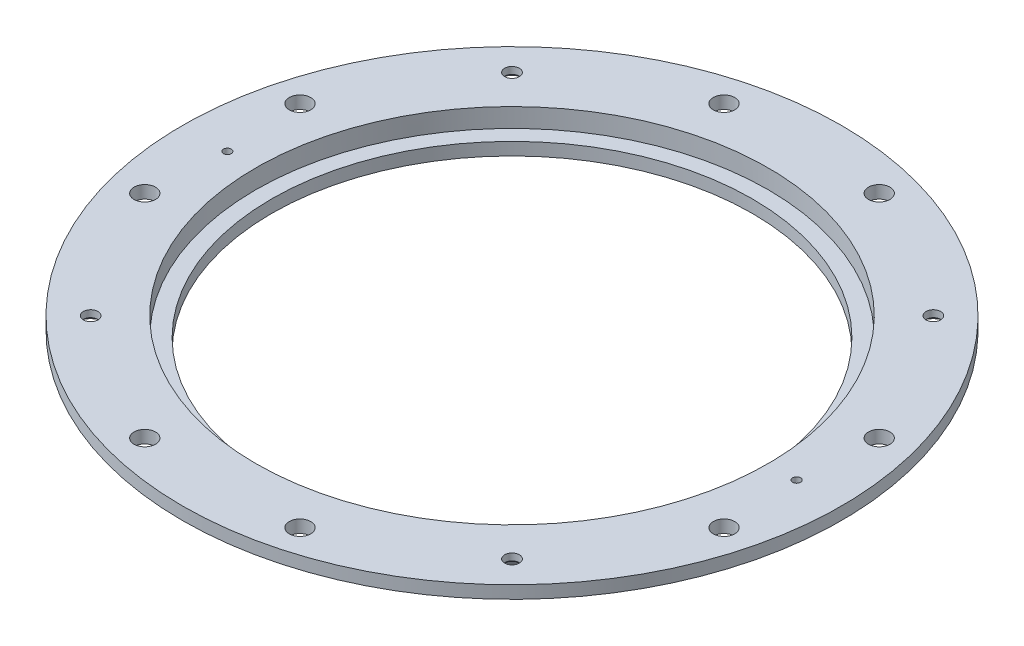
from build123d import *

# Parameters (mm, degrees)
SKETCH1_R                                         = 66.167
BOSS_EXTRUDE1_DEPTH                               = 2.54
SKETCH2_R                                         = 52.07
BOSS_EXTRUDE2_DEPTH                               = 3.81
SKETCH6_R                                         = 42.418
CUT_EXTRUDE3_DEPTH                                = 94.789478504
SKETCH7_R                                         = 45.72
CUT_EXTRUDE4_DEPTH                                = 3.81
F_1_16_0_0625_CLEARANCE_DOWEL_HOLE1_D             = 1.5875
CSK_FOR_4_FLAT_HEAD_MACHINE_SCREW_100_D           = 2.9464
CSK_FOR_4_FLAT_HEAD_MACHINE_SCREW_100_CSINK_D     = 5.715
CSK_FOR_4_FLAT_HEAD_MACHINE_SCREW_100_CSINK_ANGLE = 100
F_18_0_1695_DIAMETER_HOLE1_D                      = 4.3053
SKETCH15_R                                        = 51.435
CUT_EXTRUDE5_DEPTH                                = 3.81
SKETCH16_R                                        = 48.26
CUT_EXTRUDE6_DEPTH                                = 94.651801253


with BuildPart() as part:
    # Sketch1 → Boss-Extrude1 (new body)
    with BuildSketch(Plane(origin=(0, 0, 0), x_dir=(1, 0, 0), z_dir=(0, 1, 0))):
        with Locations(Location((0, 0, 0), (0, 0, 270))):
            Circle(SKETCH1_R)
    extrude(amount=BOSS_EXTRUDE1_DEPTH)

    # Sketch2 → Boss-Extrude2 (add)
    with BuildSketch(Plane.XZ):
        with Locations(Location((0, 0, 0), (0, 0, 90))):
            Circle(SKETCH2_R)
    extrude(amount=BOSS_EXTRUDE2_DEPTH)

    # Sketch6 → Cut-Extrude3 (cut, through all)
    with BuildSketch(Plane(origin=(0, 2.54, 0), x_dir=(1, 0, 0), z_dir=(0, 1, 0))):
        with Locations(Location((0, 0, 0), (0, 0, 270))):
            Circle(SKETCH6_R)
    extrude(amount=-CUT_EXTRUDE3_DEPTH, mode=Mode.SUBTRACT)

    # Sketch7 → Cut-Extrude4 (cut)
    with BuildSketch(Plane(origin=(0, 2.54, 0), x_dir=(1, 0, 0), z_dir=(0, 1, 0))):
        with Locations(Location((0, 0, 0), (0, 0, 270))):
            Circle(SKETCH7_R)
    extrude(amount=-CUT_EXTRUDE4_DEPTH, mode=Mode.SUBTRACT)

    # 1_16 _0.0625_ Clearance Dowel Hole1 (through all)
    with Locations(Plane(origin=(0, 2.54, 0), x_dir=(1, 0, 0), z_dir=(0, 1, 0))):
        with Locations((57.15, 0), (-57.15, 0)):
            Hole(F_1_16_0_0625_CLEARANCE_DOWEL_HOLE1_D / 2)

    # CSK for _4 Flat Head Machine Screw _100 (through all)
    with Locations(Plane(origin=(0, 0, 0), x_dir=(-1, 0, 0), z_dir=(0, -1, 0))):
        with Locations((42.29700633, 42.29700633), (42.29700633, -42.29700633), (-42.29700633, -42.29700633), (-42.29700633, 42.29700633)):
            CounterSinkHole(CSK_FOR_4_FLAT_HEAD_MACHINE_SCREW_100_D / 2, CSK_FOR_4_FLAT_HEAD_MACHINE_SCREW_100_CSINK_D / 2, counter_sink_angle=CSK_FOR_4_FLAT_HEAD_MACHINE_SCREW_100_CSINK_ANGLE)

    # 18 _0.1695_ Diameter Hole1 (through all)
    with Locations(Plane(origin=(0, 2.54, 0), x_dir=(1, 0, 0), z_dir=(0, 1, 0))):
        with Locations((-58.146802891, -15.580388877), (-58.146802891, 15.580388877), (-15.580395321, 58.146818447), (15.580382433, 58.146818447), (58.146802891, 15.580388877), (58.146802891, -15.580388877), (15.580388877, -58.146802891), (-15.580388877, -58.146802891)):
            Hole(F_18_0_1695_DIAMETER_HOLE1_D / 2)

    # Sketch15 → Cut-Extrude5 (cut)
    with BuildSketch(Plane(origin=(0, 2.54, 0), x_dir=(1, 0, 0), z_dir=(0, 1, 0))):
        with Locations(Location((0, 0, 0), (0, 0, 270))):
            Circle(SKETCH15_R)
    extrude(amount=-CUT_EXTRUDE5_DEPTH, mode=Mode.SUBTRACT)

    # Sketch16 → Cut-Extrude6 (cut, through all)
    with BuildSketch(Plane(origin=(0, -1.27, 0), x_dir=(1, 0, 0), z_dir=(0, 1, 0))):
        with Locations(Location((0, 0, 0), (0, 0, 270))):
            Circle(SKETCH16_R)
    extrude(amount=-CUT_EXTRUDE6_DEPTH, mode=Mode.SUBTRACT)


solid = part.part
